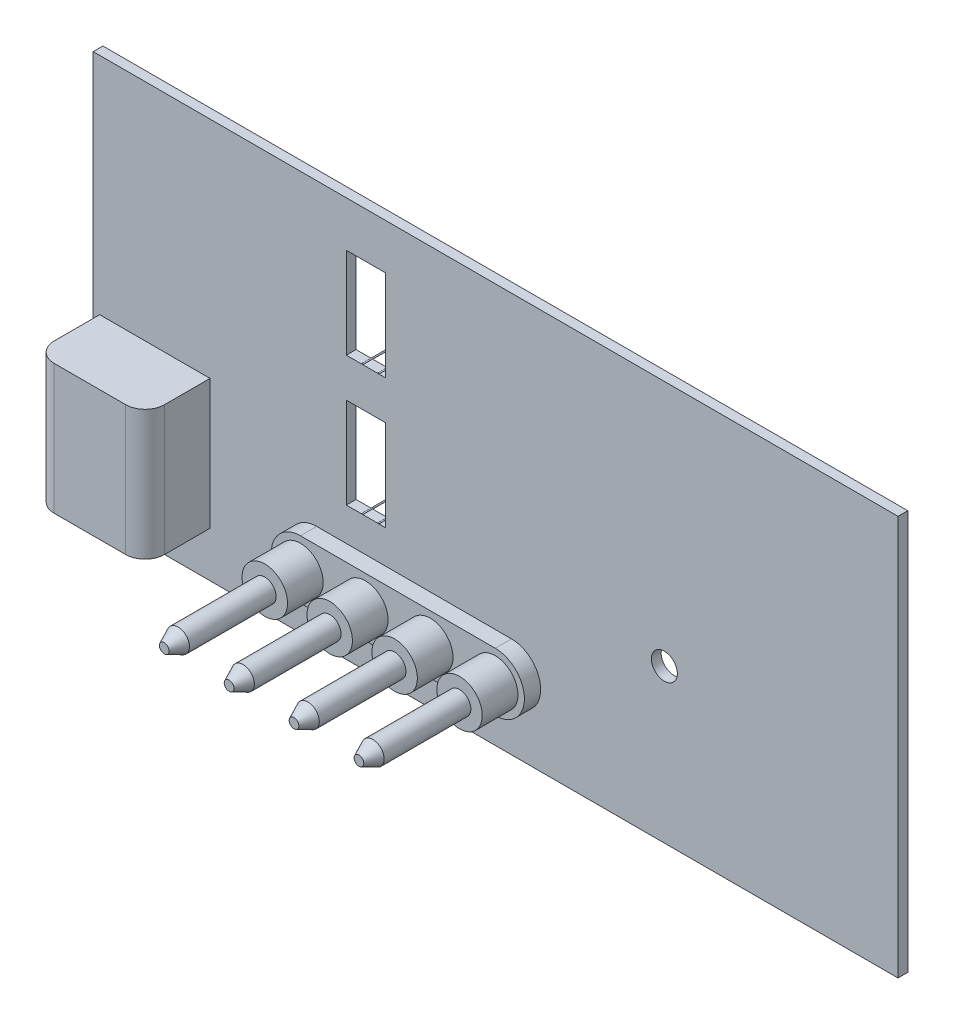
from build123d import *
from OCP.BRepFilletAPI import BRepFilletAPI_MakeChamfer

# Parameters (mm, degrees)
ESQUISSE1_W             = 124
ESQUISSE1_H             = 61.6
ESQUISSE1_R             = 2
EXTRUSION1_DEPTH        = 1.5
ESQUISSE2_W             = 17
ESQUISSE2_H             = 20
EXTRUSION2_DEPTH        = 10
CONG_1_R                = 3
EXTRUSION3_DEPTH        = 2.5
ESQUISSE4_R             = 3.5
EXTRUSION4_DEPTH        = 9.5
ESQUISSE5_R             = 1.75
EXTRUSION5_DEPTH        = 25
CHANFREIN1_SIZE         = 1
CHANFREIN1_SIZE2        = 2.144506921
ESQUISSE6_W             = 6
ESQUISSE6_H             = 14
ENL_V_MAT_EXTRU_1_DEPTH = 10
EXTRUSION6_START        = 6
ESQUISSE8_R             = 2.5
EXTRUSION6_DEPTH        = 7
EXTRUSION6_2_DEPTH      = 7
CONG_2_R                = 2
CONG_3_R                = 2
ESQUISSE9_R             = 3
EXTRUSION7_DEPTH        = 1
ESQUISSE10_R            = 0.1
EXTRUSION8_DEPTH        = 6.5
EXTRUSION8_2_DEPTH      = 6.5
EXTRUSION8_3_DEPTH      = 6.5
EXTRUSION8_4_DEPTH      = 6.5
EXTRUSION9_START        = 1.5
ESQUISSE11_R            = 2.5
EXTRUSION9_DEPTH        = 1
ESQUISSE12_R            = 2
EXTRUSION10_DEPTH       = 8
CONG_4_R                = 2
ESQUISSE13_R            = 0.1
EXTRUSION11_DEPTH       = 4
EXTRUSION12_START       = 3
EXTRUSION12_DEPTH       = 1
ESQUISSE15_R            = 1.5
EXTRUSION13_DEPTH       = 3
CONG_5_R                = 1.5


with BuildPart() as part:
    # Esquisse1 → Extrusion1 (new body)
    with BuildSketch(Plane.XY):
        with Locations((-26, 7.2)):
            Rectangle(ESQUISSE1_W, ESQUISSE1_H)
        Circle(ESQUISSE1_R, mode=Mode.SUBTRACT)
    extrude(amount=EXTRUSION1_DEPTH)

    # Esquisse2 → Extrusion2 (add)
    with BuildSketch(Plane.XY.offset(1.5)):
        with Locations((-78.5, -6.6)):
            Rectangle(ESQUISSE2_W, ESQUISSE2_H)
    extrude(amount=EXTRUSION2_DEPTH)

    # Cong_1
    cong_1_edges = [part.edges().sort_by_distance(p)[0] for p in [
        (-87, -6.6, 11.5),
        (-70, -6.6, 11.5),
    ]]
    fillet(cong_1_edges, radius=CONG_1_R)

    # Esquisse3 → Extrusion3 (add)
    with BuildSketch(Plane.XY.offset(1.5)):
        with BuildLine():
            Line((-53.56, -8.13), (-23.56, -8.13))
            ThreePointArc((-23.56, -8.13), (-19.06, -12.63), (-23.56, -17.13))
            Line((-23.56, -17.13), (-53.56, -17.13))
            ThreePointArc((-53.56, -17.13), (-58.06, -12.63), (-53.56, -8.13))
        make_face()
    extrude(amount=EXTRUSION3_DEPTH)

    # Esquisse4 → Extrusion4 (add)
    with BuildSketch(Plane(origin=(0, 0, 0), x_dir=(-1, 0, 0), z_dir=(0, 0, -1))):
        with Locations((53.56, -12.63)):
            Circle(ESQUISSE4_R)
        with Locations((43.56, -12.63)):
            Circle(ESQUISSE4_R)
        with Locations((33.56, -12.63)):
            Circle(ESQUISSE4_R)
        with Locations((23.56, -12.63)):
            Circle(ESQUISSE4_R)
    extrude(amount=-EXTRUSION4_DEPTH)

    # Esquisse5 → Extrusion5 (add)
    with BuildSketch(Plane(origin=(0, 0, 0), x_dir=(-1, 0, 0), z_dir=(0, 0, -1))):
        with Locations((53.56, -12.63)):
            Circle(ESQUISSE5_R)
        with Locations((43.56, -12.63)):
            Circle(ESQUISSE5_R)
        with Locations((33.56, -12.63)):
            Circle(ESQUISSE5_R)
        with Locations((23.56, -12.63)):
            Circle(ESQUISSE5_R)
    extrude(amount=-EXTRUSION5_DEPTH)

    # Chanfrein1: one chamfer whose edges measure the first distance from different faces: ONE call of the kernel's chamfer builder (chamfer() names one face for all edges)
    chanfrein1_edges_1 = [part.edges().sort_by_distance(p)[0] for p in [
        (-51.81, -12.63, 25),
    ]]
    chanfrein1_side_1 = [part.faces().sort_by_distance(p)[0] for p in [
        (-53.56, -12.63, 25),
    ]]
    chanfrein1_edges_2 = [part.edges().sort_by_distance(p)[0] for p in [
        (-41.81, -12.63, 25),
    ]]
    chanfrein1_side_2 = [part.faces().sort_by_distance(p)[0] for p in [
        (-43.56, -12.63, 25),
    ]]
    chanfrein1_edges_3 = [part.edges().sort_by_distance(p)[0] for p in [
        (-31.81, -12.63, 25),
    ]]
    chanfrein1_side_3 = [part.faces().sort_by_distance(p)[0] for p in [
        (-33.56, -12.63, 25),
    ]]
    chanfrein1_edges_4 = [part.edges().sort_by_distance(p)[0] for p in [
        (-21.81, -12.63, 25),
    ]]
    chanfrein1_side_4 = [part.faces().sort_by_distance(p)[0] for p in [
        (-23.56, -12.63, 25),
    ]]
    chanfrein1 = BRepFilletAPI_MakeChamfer(part.part.solid().wrapped)
    for e in chanfrein1_edges_1:
        chanfrein1.Add(CHANFREIN1_SIZE, CHANFREIN1_SIZE2, e.wrapped, chanfrein1_side_1[0].wrapped)  # the first distance lies on this face
    for e in chanfrein1_edges_2:
        chanfrein1.Add(CHANFREIN1_SIZE, CHANFREIN1_SIZE2, e.wrapped, chanfrein1_side_2[0].wrapped)  # the first distance lies on this face
    for e in chanfrein1_edges_3:
        chanfrein1.Add(CHANFREIN1_SIZE, CHANFREIN1_SIZE2, e.wrapped, chanfrein1_side_3[0].wrapped)  # the first distance lies on this face
    for e in chanfrein1_edges_4:
        chanfrein1.Add(CHANFREIN1_SIZE, CHANFREIN1_SIZE2, e.wrapped, chanfrein1_side_4[0].wrapped)  # the first distance lies on this face
    add(Compound.cast(chanfrein1.Shape()), mode=Mode.REPLACE)

    # Esquisse6 → Enl_v. mat.-Extru.1 (cut)
    with BuildSketch(Plane.XY.offset(1.5)):
        with Locations((-46, 4)):
            Rectangle(ESQUISSE6_W, ESQUISSE6_H)
        with Locations((-46, 24)):
            Rectangle(ESQUISSE6_W, ESQUISSE6_H)
    extrude(amount=-ENL_V_MAT_EXTRU_1_DEPTH, mode=Mode.SUBTRACT)



with BuildPart() as body_2:
    # Esquisse8 → Extrusion6 (new body)
    with BuildSketch(Plane(origin=(0, 0, 0), x_dir=(-1, 0, 0), z_dir=(0, 0, -1)).offset(EXTRUSION6_START)):
        with Locations((45.31, -3)):
            Circle(ESQUISSE8_R)
    extrude(amount=EXTRUSION6_DEPTH)

    # Cong_2
    cong_2_edges = [body_2.edges().sort_by_distance(p)[0] for p in [
        (-42.81, -3, -13),
    ]]
    fillet(cong_2_edges, radius=CONG_2_R)

    # Esquisse9 → Extrusion7 (add)
    with BuildSketch(Plane.XY.offset(-6)):
        with Locations((-45.31, -3)):
            Circle(ESQUISSE9_R)
        with Locations((-45.31, 17)):
            Circle(ESQUISSE9_R)
    extrude(amount=EXTRUSION7_DEPTH)


with BuildPart() as body_3:
    # Esquisse8 → Extrusion6 2 (new body)
    with BuildSketch(Plane(origin=(0, 0, 0), x_dir=(-1, 0, 0), z_dir=(0, 0, -1)).offset(EXTRUSION6_START)):
        with Locations((45.31, 17)):
            Circle(ESQUISSE8_R)
    extrude(amount=EXTRUSION6_2_DEPTH)

    # Cong_3
    cong_3_edges = [body_3.edges().sort_by_distance(p)[0] for p in [
        (-42.81, 17, -13),
    ]]
    fillet(cong_3_edges, radius=CONG_3_R)


with BuildPart() as extrusion7_piece_1:
    # of the separate pieces the step leaves, piece 1, a body of its own (extrusion7_pieces)
    add(body_2.part.solids().sort_by_distance((-42.31, -3, -6))[0])


with BuildPart() as extrusion7_piece_2:
    # of the separate pieces the step leaves, piece 2, a body of its own (extrusion7_pieces)
    add(body_2.part.solids().sort_by_distance((-42.31, 17, -6))[0])


with BuildPart() as body_5:
    # Esquisse10 → Extrusion8 (new body)
    with BuildSketch(Plane.XY.offset(-5)):
        with Locations((-46.56, -3)):
            Circle(ESQUISSE10_R)
    extrude(amount=EXTRUSION8_DEPTH)


with BuildPart() as body_6:
    # Esquisse10 → Extrusion8 2 (new body)
    with BuildSketch(Plane.XY.offset(-5)):
        with Locations((-44.06, -3)):
            Circle(ESQUISSE10_R)
    extrude(amount=EXTRUSION8_2_DEPTH)


with BuildPart() as body_7:
    # Esquisse10 → Extrusion8 3 (new body)
    with BuildSketch(Plane.XY.offset(-5)):
        with Locations((-46.56, 17)):
            Circle(ESQUISSE10_R)
    extrude(amount=EXTRUSION8_3_DEPTH)


with BuildPart() as body_8:
    # Esquisse10 → Extrusion8 4 (new body)
    with BuildSketch(Plane.XY.offset(-5)):
        with Locations((-44.06, 17)):
            Circle(ESQUISSE10_R)
    extrude(amount=EXTRUSION8_4_DEPTH)


with BuildPart() as body_9:
    # Esquisse11 → Extrusion9 (new body)
    with BuildSketch(Plane(origin=(0, 0, 0), x_dir=(-1, 0, 0), z_dir=(0, 0, -1)).offset(EXTRUSION9_START)):
        with Locations((45.31, -22.5)):
            Circle(ESQUISSE11_R)
    extrude(amount=EXTRUSION9_DEPTH)

    # Esquisse12 → Extrusion10 (add)
    with BuildSketch(Plane(origin=(0, 0, -2.5), x_dir=(-1, 0, 0), z_dir=(0, 0, -1))):
        with Locations((45.31, -22.5)):
            Circle(ESQUISSE12_R)
    extrude(amount=EXTRUSION10_DEPTH)

    # Cong_4
    cong_4_edges = [body_9.edges().sort_by_distance(p)[0] for p in [
        (-43.31, -22.5, -10.5),
    ]]
    fillet(cong_4_edges, radius=CONG_4_R)


with BuildPart() as part_1:
    add(part.part)

    add(body_9.part)  # Extrusion11 merges body 9
    # Esquisse13 → Extrusion11 (add)
    with BuildSketch(Plane.XY.offset(1.5)):
        with Locations(Location((-46.459279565, -23.6, 0), (0, 0, 180))):
            Circle(ESQUISSE13_R)
        with Locations(Location((-45.369513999, -23.6, 0), (0, 0, 180))):
            Circle(ESQUISSE13_R)
        with Locations(Location((-44.260288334, -23.6, 0), (0, 0, 180))):
            Circle(ESQUISSE13_R)
    extrude(amount=-EXTRUSION11_DEPTH)


with BuildPart() as body_9_2:
    # Esquisse14 → Extrusion12 (new body)
    with BuildSketch(Plane(origin=(0, 0, 0), x_dir=(-1, 0, 0), z_dir=(0, 0, -1)).offset(EXTRUSION12_START)):
        with BuildLine():
            Line((55.31, -17.537124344), (55.31, -20.182875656))
            ThreePointArc((55.31, -20.182875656), (56.81, -20.86), (58.31, -20.182875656))
            Line((58.31, -20.182875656), (58.31, -17.537124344))
            ThreePointArc((58.31, -17.537124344), (56.81, -16.86), (55.31, -17.537124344))
        make_face()
    extrude(amount=EXTRUSION12_DEPTH)

    # Esquisse15 → Extrusion13 (add)
    with BuildSketch(Plane(origin=(0, 0, -4), x_dir=(-1, 0, 0), z_dir=(0, 0, -1))):
        with Locations((56.81, -18.86)):
            Circle(ESQUISSE15_R)
    extrude(amount=EXTRUSION13_DEPTH)

    # Cong_5
    cong_5_edges = [body_9_2.edges().sort_by_distance(p)[0] for p in [
        (-55.31, -18.86, -7),
    ]]
    fillet(cong_5_edges, radius=CONG_5_R)


solid = Compound([body_3.part, extrusion7_piece_1.part, extrusion7_piece_2.part, body_5.part, body_6.part, body_7.part, body_8.part, part_1.part, body_9_2.part])
